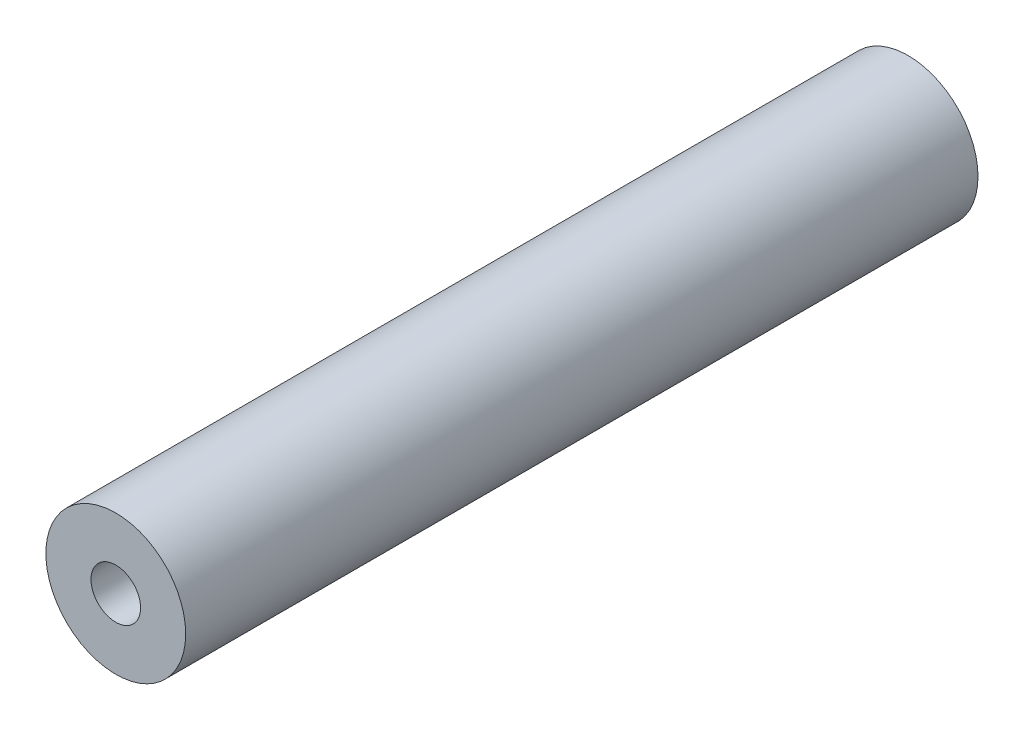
ISO-10303-21;
HEADER;
FILE_DESCRIPTION(('STEP AP214'),'2;1');
FILE_NAME('part.step','',(''),(''),'','','');
FILE_SCHEMA(('AUTOMOTIVE_DESIGN { 1 0 10303 214 1 1 1 1 }'));
ENDSEC;
DATA;
#1=APPLICATION_CONTEXT('core data for automotive mechanical design processes');
#2=APPLICATION_PROTOCOL_DEFINITION('international standard','automotive_design',2000,#1);
#3=PRODUCT_CONTEXT('',#1,'mechanical');
#4=PRODUCT('Part','Part','',(#3));
#5=PRODUCT_RELATED_PRODUCT_CATEGORY('part','',(#4));
#6=PRODUCT_DEFINITION_FORMATION('','',#4);
#7=PRODUCT_DEFINITION_CONTEXT('part definition',#1,'design');
#8=PRODUCT_DEFINITION('design','',#6,#7);
#9=PRODUCT_DEFINITION_SHAPE('','',#8);
#10=(LENGTH_UNIT() NAMED_UNIT(*) SI_UNIT(.MILLI.,.METRE.));
#11=(NAMED_UNIT(*) PLANE_ANGLE_UNIT() SI_UNIT($,.RADIAN.));
#12=(NAMED_UNIT(*) SI_UNIT($,.STERADIAN.) SOLID_ANGLE_UNIT());
#13=UNCERTAINTY_MEASURE_WITH_UNIT(LENGTH_MEASURE(1.E-05),#10,'distance_accuracy_value','');
#14=(GEOMETRIC_REPRESENTATION_CONTEXT(3) GLOBAL_UNCERTAINTY_ASSIGNED_CONTEXT((#13)) GLOBAL_UNIT_ASSIGNED_CONTEXT((#10,
#11,#12)) REPRESENTATION_CONTEXT('',''));
#15=CARTESIAN_POINT('',(0.,0.,0.));
#16=DIRECTION('',(0.,0.,1.));
#17=DIRECTION('',(1.,0.,0.));
#18=AXIS2_PLACEMENT_3D('',#15,#16,#17);
#19=CARTESIAN_POINT('',(0.,0.,107.95));
#20=DIRECTION('',(0.,0.,-1.));
#21=DIRECTION('',(-1.,0.,0.));
#22=AXIS2_PLACEMENT_3D('',#19,#20,#21);
#23=CYLINDRICAL_SURFACE('',#22,9.525);
#24=CARTESIAN_POINT('',(0.,0.,107.95));
#25=DIRECTION('',(0.,0.,1.));
#26=DIRECTION('',(1.,0.,0.));
#27=AXIS2_PLACEMENT_3D('',#24,#25,#26);
#28=CIRCLE('',#27,9.525);
#29=CARTESIAN_POINT('',(9.525,0.,107.95));
#30=VERTEX_POINT('',#29);
#31=EDGE_CURVE('E10',#30,#30,#28,.T.);
#32=ORIENTED_EDGE('',*,*,#31,.F.);
#33=EDGE_LOOP('',(#32));
#34=FACE_BOUND('',#33,.T.);
#35=CARTESIAN_POINT('',(0.,0.,0.));
#36=DIRECTION('',(0.,0.,1.));
#37=DIRECTION('',(1.,0.,0.));
#38=AXIS2_PLACEMENT_3D('',#35,#36,#37);
#39=CIRCLE('',#38,9.525);
#40=CARTESIAN_POINT('',(9.525,0.,0.));
#41=VERTEX_POINT('',#40);
#42=EDGE_CURVE('E34',#41,#41,#39,.T.);
#43=ORIENTED_EDGE('',*,*,#42,.T.);
#44=EDGE_LOOP('',(#43));
#45=FACE_BOUND('',#44,.T.);
#46=ADVANCED_FACE('F31',(#34,#45),#23,.T.);
#47=CARTESIAN_POINT('',(0.,0.,107.95));
#48=DIRECTION('',(0.,0.,1.));
#49=DIRECTION('',(1.,0.,0.));
#50=AXIS2_PLACEMENT_3D('',#47,#48,#49);
#51=PLANE('',#50);
#52=CARTESIAN_POINT('',(0.,0.,107.95));
#53=DIRECTION('',(0.,0.,1.));
#54=DIRECTION('',(1.,0.,0.));
#55=AXIS2_PLACEMENT_3D('',#52,#53,#54);
#56=CIRCLE('',#55,3.37819999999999);
#57=CARTESIAN_POINT('',(3.37819999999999,0.,107.95));
#58=VERTEX_POINT('',#57);
#59=EDGE_CURVE('E45',#58,#58,#56,.T.);
#60=ORIENTED_EDGE('',*,*,#59,.F.);
#61=EDGE_LOOP('',(#60));
#62=FACE_BOUND('',#61,.T.);
#63=ORIENTED_EDGE('',*,*,#31,.T.);
#64=EDGE_LOOP('',(#63));
#65=FACE_BOUND('',#64,.T.);
#66=ADVANCED_FACE('F51',(#62,#65),#51,.T.);
#67=CARTESIAN_POINT('',(0.,0.,0.));
#68=DIRECTION('',(0.,0.,1.));
#69=DIRECTION('',(1.,0.,0.));
#70=AXIS2_PLACEMENT_3D('',#67,#68,#69);
#71=PLANE('',#70);
#72=CARTESIAN_POINT('',(0.,0.,0.));
#73=DIRECTION('',(0.,0.,1.));
#74=DIRECTION('',(1.,0.,0.));
#75=AXIS2_PLACEMENT_3D('',#72,#73,#74);
#76=CIRCLE('',#75,3.37819999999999);
#77=CARTESIAN_POINT('',(3.37819999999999,0.,0.));
#78=VERTEX_POINT('',#77);
#79=EDGE_CURVE('E41',#78,#78,#76,.T.);
#80=ORIENTED_EDGE('',*,*,#79,.T.);
#81=EDGE_LOOP('',(#80));
#82=FACE_BOUND('',#81,.T.);
#83=ORIENTED_EDGE('',*,*,#42,.F.);
#84=EDGE_LOOP('',(#83));
#85=FACE_BOUND('',#84,.T.);
#86=ADVANCED_FACE('F53',(#82,#85),#71,.F.);
#87=CARTESIAN_POINT('',(0.,0.,107.95));
#88=DIRECTION('',(0.,0.,1.));
#89=DIRECTION('',(1.,0.,0.));
#90=AXIS2_PLACEMENT_3D('',#87,#88,#89);
#91=CYLINDRICAL_SURFACE('',#90,3.37819999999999);
#92=ORIENTED_EDGE('',*,*,#79,.F.);
#93=EDGE_LOOP('',(#92));
#94=FACE_BOUND('',#93,.T.);
#95=ORIENTED_EDGE('',*,*,#59,.T.);
#96=EDGE_LOOP('',(#95));
#97=FACE_BOUND('',#96,.T.);
#98=ADVANCED_FACE('F49',(#94,#97),#91,.F.);
#99=CLOSED_SHELL('',(#46,#66,#86,#98));
#100=MANIFOLD_SOLID_BREP('B2',#99);
#101=ADVANCED_BREP_SHAPE_REPRESENTATION('',(#18,#100),#14);
#102=SHAPE_DEFINITION_REPRESENTATION(#9,#101);
ENDSEC;
END-ISO-10303-21;
